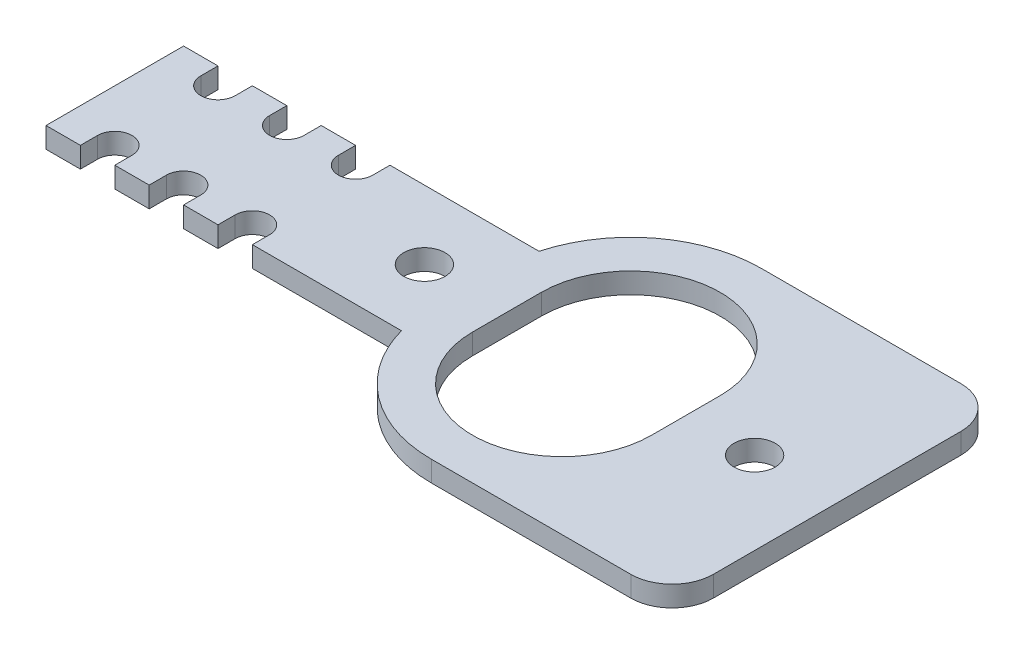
ISO-10303-21;
HEADER;
FILE_DESCRIPTION(('STEP AP214'),'2;1');
FILE_NAME('part.step','',(''),(''),'','','');
FILE_SCHEMA(('AUTOMOTIVE_DESIGN { 1 0 10303 214 1 1 1 1 }'));
ENDSEC;
DATA;
#1=APPLICATION_CONTEXT('core data for automotive mechanical design processes');
#2=APPLICATION_PROTOCOL_DEFINITION('international standard','automotive_design',2000,#1);
#3=PRODUCT_CONTEXT('',#1,'mechanical');
#4=PRODUCT('Part','Part','',(#3));
#5=PRODUCT_RELATED_PRODUCT_CATEGORY('part','',(#4));
#6=PRODUCT_DEFINITION_FORMATION('','',#4);
#7=PRODUCT_DEFINITION_CONTEXT('part definition',#1,'design');
#8=PRODUCT_DEFINITION('design','',#6,#7);
#9=PRODUCT_DEFINITION_SHAPE('','',#8);
#10=(LENGTH_UNIT() NAMED_UNIT(*) SI_UNIT(.MILLI.,.METRE.));
#11=(NAMED_UNIT(*) PLANE_ANGLE_UNIT() SI_UNIT($,.RADIAN.));
#12=(NAMED_UNIT(*) SI_UNIT($,.STERADIAN.) SOLID_ANGLE_UNIT());
#13=UNCERTAINTY_MEASURE_WITH_UNIT(LENGTH_MEASURE(1.E-05),#10,'distance_accuracy_value','');
#14=(GEOMETRIC_REPRESENTATION_CONTEXT(3) GLOBAL_UNCERTAINTY_ASSIGNED_CONTEXT((#13)) GLOBAL_UNIT_ASSIGNED_CONTEXT((#10,
#11,#12)) REPRESENTATION_CONTEXT('',''));
#15=CARTESIAN_POINT('',(0.,0.,0.));
#16=DIRECTION('',(0.,0.,1.));
#17=DIRECTION('',(1.,0.,0.));
#18=AXIS2_PLACEMENT_3D('',#15,#16,#17);
#19=CARTESIAN_POINT('',(7.5,3.,-31.5));
#20=DIRECTION('',(0.,1.,0.));
#21=DIRECTION('',(0.,0.,1.));
#22=AXIS2_PLACEMENT_3D('',#19,#20,#21);
#23=PLANE('',#22);
#24=CARTESIAN_POINT('',(45.,3.,-24.));
#25=DIRECTION('',(0.,1.,0.));
#26=DIRECTION('',(0.,0.,1.));
#27=AXIS2_PLACEMENT_3D('',#24,#25,#26);
#28=CIRCLE('',#27,3.);
#29=CARTESIAN_POINT('',(45.,3.,-21.));
#30=VERTEX_POINT('',#29);
#31=EDGE_CURVE('E305',#30,#30,#28,.T.);
#32=ORIENTED_EDGE('',*,*,#31,.F.);
#33=EDGE_LOOP('',(#32));
#34=FACE_BOUND('',#33,.T.);
#35=CARTESIAN_POINT('',(7.5,3.,-31.5));
#36=DIRECTION('',(0.,-1.,0.));
#37=DIRECTION('',(0.,0.,1.));
#38=AXIS2_PLACEMENT_3D('',#35,#36,#37);
#39=CIRCLE('',#38,2.5);
#40=CARTESIAN_POINT('',(10.,3.,-31.5));
#41=VERTEX_POINT('',#40);
#42=CARTESIAN_POINT('',(5.,3.,-31.5));
#43=VERTEX_POINT('',#42);
#44=EDGE_CURVE('E315',#41,#43,#39,.T.);
#45=ORIENTED_EDGE('',*,*,#44,.T.);
#46=DIRECTION('',(0.,0.,-1.));
#47=VECTOR('',#46,1.);
#48=CARTESIAN_POINT('',(5.,3.,-31.5));
#49=LINE('',#48,#47);
#50=CARTESIAN_POINT('',(5.,3.,-34.));
#51=VERTEX_POINT('',#50);
#52=EDGE_CURVE('E318',#43,#51,#49,.T.);
#53=ORIENTED_EDGE('',*,*,#52,.T.);
#54=DIRECTION('',(-1.,0.,0.));
#55=VECTOR('',#54,1.);
#56=CARTESIAN_POINT('',(0.,3.,-34.));
#57=LINE('',#56,#55);
#58=CARTESIAN_POINT('',(0.,3.,-34.));
#59=VERTEX_POINT('',#58);
#60=EDGE_CURVE('E321',#51,#59,#57,.T.);
#61=ORIENTED_EDGE('',*,*,#60,.T.);
#62=DIRECTION('',(0.,0.,1.));
#63=VECTOR('',#62,1.);
#64=CARTESIAN_POINT('',(0.,3.,-14.));
#65=LINE('',#64,#63);
#66=CARTESIAN_POINT('',(0.,3.,-14.));
#67=VERTEX_POINT('',#66);
#68=EDGE_CURVE('E323',#59,#67,#65,.T.);
#69=ORIENTED_EDGE('',*,*,#68,.T.);
#70=DIRECTION('',(1.,0.,0.));
#71=VECTOR('',#70,1.);
#72=CARTESIAN_POINT('',(0.,3.,-14.));
#73=LINE('',#72,#71);
#74=CARTESIAN_POINT('',(5.,3.,-14.));
#75=VERTEX_POINT('',#74);
#76=EDGE_CURVE('E325',#67,#75,#73,.T.);
#77=ORIENTED_EDGE('',*,*,#76,.T.);
#78=DIRECTION('',(0.,0.,-1.));
#79=VECTOR('',#78,1.);
#80=CARTESIAN_POINT('',(5.,3.,-16.5));
#81=LINE('',#80,#79);
#82=CARTESIAN_POINT('',(5.,3.,-16.5));
#83=VERTEX_POINT('',#82);
#84=EDGE_CURVE('E327',#75,#83,#81,.T.);
#85=ORIENTED_EDGE('',*,*,#84,.T.);
#86=CARTESIAN_POINT('',(7.5,3.,-16.5));
#87=DIRECTION('',(0.,-1.,0.));
#88=DIRECTION('',(0.,0.,1.));
#89=AXIS2_PLACEMENT_3D('',#86,#87,#88);
#90=CIRCLE('',#89,2.5);
#91=CARTESIAN_POINT('',(10.,3.,-16.5));
#92=VERTEX_POINT('',#91);
#93=EDGE_CURVE('E329',#83,#92,#90,.T.);
#94=ORIENTED_EDGE('',*,*,#93,.T.);
#95=DIRECTION('',(0.,0.,1.));
#96=VECTOR('',#95,1.);
#97=CARTESIAN_POINT('',(10.,3.,-16.5));
#98=LINE('',#97,#96);
#99=CARTESIAN_POINT('',(10.,3.,-14.));
#100=VERTEX_POINT('',#99);
#101=EDGE_CURVE('E331',#92,#100,#98,.T.);
#102=ORIENTED_EDGE('',*,*,#101,.T.);
#103=DIRECTION('',(1.,0.,0.));
#104=VECTOR('',#103,1.);
#105=CARTESIAN_POINT('',(10.,3.,-14.));
#106=LINE('',#105,#104);
#107=CARTESIAN_POINT('',(15.,3.,-14.));
#108=VERTEX_POINT('',#107);
#109=EDGE_CURVE('E333',#100,#108,#106,.T.);
#110=ORIENTED_EDGE('',*,*,#109,.T.);
#111=DIRECTION('',(0.,0.,-1.));
#112=VECTOR('',#111,1.);
#113=CARTESIAN_POINT('',(15.,3.,-16.5));
#114=LINE('',#113,#112);
#115=CARTESIAN_POINT('',(15.,3.,-16.5));
#116=VERTEX_POINT('',#115);
#117=EDGE_CURVE('E335',#108,#116,#114,.T.);
#118=ORIENTED_EDGE('',*,*,#117,.T.);
#119=CARTESIAN_POINT('',(17.5,3.,-16.5));
#120=DIRECTION('',(0.,-1.,0.));
#121=DIRECTION('',(0.,0.,1.));
#122=AXIS2_PLACEMENT_3D('',#119,#120,#121);
#123=CIRCLE('',#122,2.5);
#124=CARTESIAN_POINT('',(20.,3.,-16.5));
#125=VERTEX_POINT('',#124);
#126=EDGE_CURVE('E337',#116,#125,#123,.T.);
#127=ORIENTED_EDGE('',*,*,#126,.T.);
#128=DIRECTION('',(0.,0.,1.));
#129=VECTOR('',#128,1.);
#130=CARTESIAN_POINT('',(20.,3.,-16.5));
#131=LINE('',#130,#129);
#132=CARTESIAN_POINT('',(20.,3.,-14.));
#133=VERTEX_POINT('',#132);
#134=EDGE_CURVE('E339',#125,#133,#131,.T.);
#135=ORIENTED_EDGE('',*,*,#134,.T.);
#136=DIRECTION('',(1.,0.,0.));
#137=VECTOR('',#136,1.);
#138=CARTESIAN_POINT('',(20.,3.,-14.));
#139=LINE('',#138,#137);
#140=CARTESIAN_POINT('',(25.,3.,-14.));
#141=VERTEX_POINT('',#140);
#142=EDGE_CURVE('E341',#133,#141,#139,.T.);
#143=ORIENTED_EDGE('',*,*,#142,.T.);
#144=DIRECTION('',(0.,0.,-1.));
#145=VECTOR('',#144,1.);
#146=CARTESIAN_POINT('',(25.,3.,-16.5));
#147=LINE('',#146,#145);
#148=CARTESIAN_POINT('',(25.,3.,-16.5));
#149=VERTEX_POINT('',#148);
#150=EDGE_CURVE('E343',#141,#149,#147,.T.);
#151=ORIENTED_EDGE('',*,*,#150,.T.);
#152=CARTESIAN_POINT('',(27.5,3.,-16.5));
#153=DIRECTION('',(0.,-1.,0.));
#154=DIRECTION('',(0.,0.,1.));
#155=AXIS2_PLACEMENT_3D('',#152,#153,#154);
#156=CIRCLE('',#155,2.5);
#157=CARTESIAN_POINT('',(30.,3.,-16.5));
#158=VERTEX_POINT('',#157);
#159=EDGE_CURVE('E345',#149,#158,#156,.T.);
#160=ORIENTED_EDGE('',*,*,#159,.T.);
#161=DIRECTION('',(0.,0.,1.));
#162=VECTOR('',#161,1.);
#163=CARTESIAN_POINT('',(30.,3.,-16.5));
#164=LINE('',#163,#162);
#165=CARTESIAN_POINT('',(30.,3.,-14.));
#166=VERTEX_POINT('',#165);
#167=EDGE_CURVE('E347',#158,#166,#164,.T.);
#168=ORIENTED_EDGE('',*,*,#167,.T.);
#169=DIRECTION('',(1.,0.,0.));
#170=VECTOR('',#169,1.);
#171=CARTESIAN_POINT('',(30.,3.,-14.));
#172=LINE('',#171,#170);
#173=CARTESIAN_POINT('',(51.6696972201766,3.,-14.));
#174=VERTEX_POINT('',#173);
#175=EDGE_CURVE('E349',#166,#174,#172,.T.);
#176=ORIENTED_EDGE('',*,*,#175,.T.);
#177=CARTESIAN_POINT('',(70.,3.,-19.));
#178=DIRECTION('',(0.,1.,0.));
#179=DIRECTION('',(0.,0.,1.));
#180=AXIS2_PLACEMENT_3D('',#177,#178,#179);
#181=CIRCLE('',#180,19.);
#182=CARTESIAN_POINT('',(70.,3.,0.));
#183=VERTEX_POINT('',#182);
#184=EDGE_CURVE('E351',#174,#183,#181,.T.);
#185=ORIENTED_EDGE('',*,*,#184,.T.);
#186=DIRECTION('',(1.,0.,0.));
#187=VECTOR('',#186,1.);
#188=CARTESIAN_POINT('',(70.,3.,0.));
#189=LINE('',#188,#187);
#190=CARTESIAN_POINT('',(98.9999999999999,3.,0.));
#191=VERTEX_POINT('',#190);
#192=EDGE_CURVE('E353',#183,#191,#189,.T.);
#193=ORIENTED_EDGE('',*,*,#192,.T.);
#194=CARTESIAN_POINT('',(99.,3.,-6.));
#195=DIRECTION('',(0.,1.,0.));
#196=DIRECTION('',(0.,0.,1.));
#197=AXIS2_PLACEMENT_3D('',#194,#195,#196);
#198=CIRCLE('',#197,6.);
#199=CARTESIAN_POINT('',(105.,3.,-6.00000000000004));
#200=VERTEX_POINT('',#199);
#201=EDGE_CURVE('E355',#191,#200,#198,.T.);
#202=ORIENTED_EDGE('',*,*,#201,.T.);
#203=DIRECTION('',(0.,0.,-1.));
#204=VECTOR('',#203,1.);
#205=CARTESIAN_POINT('',(105.,3.,-6.00000000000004));
#206=LINE('',#205,#204);
#207=CARTESIAN_POINT('',(105.,3.,-42.));
#208=VERTEX_POINT('',#207);
#209=EDGE_CURVE('E357',#200,#208,#206,.T.);
#210=ORIENTED_EDGE('',*,*,#209,.T.);
#211=CARTESIAN_POINT('',(99.,3.,-42.));
#212=DIRECTION('',(0.,1.,0.));
#213=DIRECTION('',(0.,0.,1.));
#214=AXIS2_PLACEMENT_3D('',#211,#212,#213);
#215=CIRCLE('',#214,6.);
#216=CARTESIAN_POINT('',(98.9999999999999,3.,-48.));
#217=VERTEX_POINT('',#216);
#218=EDGE_CURVE('E359',#208,#217,#215,.T.);
#219=ORIENTED_EDGE('',*,*,#218,.T.);
#220=DIRECTION('',(-1.,0.,0.));
#221=VECTOR('',#220,1.);
#222=CARTESIAN_POINT('',(70.,3.,-48.));
#223=LINE('',#222,#221);
#224=CARTESIAN_POINT('',(70.,3.,-48.));
#225=VERTEX_POINT('',#224);
#226=EDGE_CURVE('E361',#217,#225,#223,.T.);
#227=ORIENTED_EDGE('',*,*,#226,.T.);
#228=CARTESIAN_POINT('',(70.,3.,-29.));
#229=DIRECTION('',(0.,1.,0.));
#230=DIRECTION('',(0.,0.,1.));
#231=AXIS2_PLACEMENT_3D('',#228,#229,#230);
#232=CIRCLE('',#231,19.);
#233=CARTESIAN_POINT('',(51.6696972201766,3.,-34.));
#234=VERTEX_POINT('',#233);
#235=EDGE_CURVE('E363',#225,#234,#232,.T.);
#236=ORIENTED_EDGE('',*,*,#235,.T.);
#237=DIRECTION('',(-1.,0.,0.));
#238=VECTOR('',#237,1.);
#239=CARTESIAN_POINT('',(30.,3.,-34.));
#240=LINE('',#239,#238);
#241=CARTESIAN_POINT('',(30.,3.,-34.));
#242=VERTEX_POINT('',#241);
#243=EDGE_CURVE('E365',#234,#242,#240,.T.);
#244=ORIENTED_EDGE('',*,*,#243,.T.);
#245=DIRECTION('',(0.,0.,1.));
#246=VECTOR('',#245,1.);
#247=CARTESIAN_POINT('',(30.,3.,-31.5));
#248=LINE('',#247,#246);
#249=CARTESIAN_POINT('',(30.,3.,-31.5));
#250=VERTEX_POINT('',#249);
#251=EDGE_CURVE('E367',#242,#250,#248,.T.);
#252=ORIENTED_EDGE('',*,*,#251,.T.);
#253=CARTESIAN_POINT('',(27.5,3.,-31.5));
#254=DIRECTION('',(0.,-1.,0.));
#255=DIRECTION('',(0.,0.,1.));
#256=AXIS2_PLACEMENT_3D('',#253,#254,#255);
#257=CIRCLE('',#256,2.5);
#258=CARTESIAN_POINT('',(25.,3.,-31.5));
#259=VERTEX_POINT('',#258);
#260=EDGE_CURVE('E369',#250,#259,#257,.T.);
#261=ORIENTED_EDGE('',*,*,#260,.T.);
#262=DIRECTION('',(0.,0.,-1.));
#263=VECTOR('',#262,1.);
#264=CARTESIAN_POINT('',(25.,3.,-31.5));
#265=LINE('',#264,#263);
#266=CARTESIAN_POINT('',(25.,3.,-34.));
#267=VERTEX_POINT('',#266);
#268=EDGE_CURVE('E371',#259,#267,#265,.T.);
#269=ORIENTED_EDGE('',*,*,#268,.T.);
#270=DIRECTION('',(-1.,0.,0.));
#271=VECTOR('',#270,1.);
#272=CARTESIAN_POINT('',(20.,3.,-34.));
#273=LINE('',#272,#271);
#274=CARTESIAN_POINT('',(20.,3.,-34.));
#275=VERTEX_POINT('',#274);
#276=EDGE_CURVE('E373',#267,#275,#273,.T.);
#277=ORIENTED_EDGE('',*,*,#276,.T.);
#278=DIRECTION('',(0.,0.,1.));
#279=VECTOR('',#278,1.);
#280=CARTESIAN_POINT('',(20.,3.,-31.5));
#281=LINE('',#280,#279);
#282=CARTESIAN_POINT('',(20.,3.,-31.5));
#283=VERTEX_POINT('',#282);
#284=EDGE_CURVE('E375',#275,#283,#281,.T.);
#285=ORIENTED_EDGE('',*,*,#284,.T.);
#286=CARTESIAN_POINT('',(17.5,3.,-31.5));
#287=DIRECTION('',(0.,-1.,0.));
#288=DIRECTION('',(0.,0.,1.));
#289=AXIS2_PLACEMENT_3D('',#286,#287,#288);
#290=CIRCLE('',#289,2.5);
#291=CARTESIAN_POINT('',(15.,3.,-31.5));
#292=VERTEX_POINT('',#291);
#293=EDGE_CURVE('E377',#283,#292,#290,.T.);
#294=ORIENTED_EDGE('',*,*,#293,.T.);
#295=DIRECTION('',(0.,0.,-1.));
#296=VECTOR('',#295,1.);
#297=CARTESIAN_POINT('',(15.,3.,-31.5));
#298=LINE('',#297,#296);
#299=CARTESIAN_POINT('',(15.,3.,-34.));
#300=VERTEX_POINT('',#299);
#301=EDGE_CURVE('E379',#292,#300,#298,.T.);
#302=ORIENTED_EDGE('',*,*,#301,.T.);
#303=DIRECTION('',(-1.,0.,0.));
#304=VECTOR('',#303,1.);
#305=CARTESIAN_POINT('',(10.,3.,-34.));
#306=LINE('',#305,#304);
#307=CARTESIAN_POINT('',(10.,3.,-34.));
#308=VERTEX_POINT('',#307);
#309=EDGE_CURVE('E381',#300,#308,#306,.T.);
#310=ORIENTED_EDGE('',*,*,#309,.T.);
#311=DIRECTION('',(0.,0.,1.));
#312=VECTOR('',#311,1.);
#313=CARTESIAN_POINT('',(10.,3.,-31.5));
#314=LINE('',#313,#312);
#315=EDGE_CURVE('E383',#308,#41,#314,.T.);
#316=ORIENTED_EDGE('',*,*,#315,.T.);
#317=EDGE_LOOP('',(#45,#53,#61,#69,#77,#85,#94,#102,#110,#118,#127,#135,#143,#151,#160,#168,
#176,#185,#193,#202,#210,#219,#227,#236,#244,#252,#261,#269,#277,#285,#294,#302,#310,#316));
#318=FACE_BOUND('',#317,.T.);
#319=DIRECTION('',(0.,0.,1.));
#320=VECTOR('',#319,1.);
#321=CARTESIAN_POINT('',(57.,3.,-29.));
#322=LINE('',#321,#320);
#323=CARTESIAN_POINT('',(57.,3.,-29.));
#324=VERTEX_POINT('',#323);
#325=CARTESIAN_POINT('',(57.,3.,-19.));
#326=VERTEX_POINT('',#325);
#327=EDGE_CURVE('E284',#324,#326,#322,.T.);
#328=ORIENTED_EDGE('',*,*,#327,.F.);
#329=CARTESIAN_POINT('',(70.,3.,-29.));
#330=DIRECTION('',(0.,1.,0.));
#331=DIRECTION('',(0.,0.,1.));
#332=AXIS2_PLACEMENT_3D('',#329,#330,#331);
#333=CIRCLE('',#332,13.);
#334=CARTESIAN_POINT('',(83.,3.,-29.));
#335=VERTEX_POINT('',#334);
#336=EDGE_CURVE('E276',#335,#324,#333,.T.);
#337=ORIENTED_EDGE('',*,*,#336,.F.);
#338=DIRECTION('',(0.,0.,-1.));
#339=VECTOR('',#338,1.);
#340=CARTESIAN_POINT('',(83.,3.,-29.));
#341=LINE('',#340,#339);
#342=CARTESIAN_POINT('',(83.,3.,-19.));
#343=VERTEX_POINT('',#342);
#344=EDGE_CURVE('E299',#343,#335,#341,.T.);
#345=ORIENTED_EDGE('',*,*,#344,.F.);
#346=CARTESIAN_POINT('',(70.,3.,-19.));
#347=DIRECTION('',(0.,1.,0.));
#348=DIRECTION('',(0.,0.,1.));
#349=AXIS2_PLACEMENT_3D('',#346,#347,#348);
#350=CIRCLE('',#349,13.);
#351=EDGE_CURVE('E297',#326,#343,#350,.T.);
#352=ORIENTED_EDGE('',*,*,#351,.F.);
#353=EDGE_LOOP('',(#328,#337,#345,#352));
#354=FACE_BOUND('',#353,.T.);
#355=CARTESIAN_POINT('',(93.,3.,-24.));
#356=DIRECTION('',(0.,1.,0.));
#357=DIRECTION('',(0.,0.,1.));
#358=AXIS2_PLACEMENT_3D('',#355,#356,#357);
#359=CIRCLE('',#358,3.00000000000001);
#360=CARTESIAN_POINT('',(93.,3.,-21.));
#361=VERTEX_POINT('',#360);
#362=EDGE_CURVE('E1066',#361,#361,#359,.T.);
#363=ORIENTED_EDGE('',*,*,#362,.F.);
#364=EDGE_LOOP('',(#363));
#365=FACE_BOUND('',#364,.T.);
#366=ADVANCED_FACE('F31',(#34,#318,#354,#365),#23,.T.);
#367=CARTESIAN_POINT('',(7.5,0.,-31.5));
#368=DIRECTION('',(0.,1.,0.));
#369=DIRECTION('',(0.,0.,1.));
#370=AXIS2_PLACEMENT_3D('',#367,#368,#369);
#371=PLANE('',#370);
#372=CARTESIAN_POINT('',(45.,0.,-24.));
#373=DIRECTION('',(0.,1.,0.));
#374=DIRECTION('',(0.,0.,1.));
#375=AXIS2_PLACEMENT_3D('',#372,#373,#374);
#376=CIRCLE('',#375,3.);
#377=CARTESIAN_POINT('',(45.,0.,-21.));
#378=VERTEX_POINT('',#377);
#379=EDGE_CURVE('E1072',#378,#378,#376,.T.);
#380=ORIENTED_EDGE('',*,*,#379,.T.);
#381=EDGE_LOOP('',(#380));
#382=FACE_BOUND('',#381,.T.);
#383=CARTESIAN_POINT('',(7.5,0.,-31.5));
#384=DIRECTION('',(0.,-1.,0.));
#385=DIRECTION('',(0.,0.,1.));
#386=AXIS2_PLACEMENT_3D('',#383,#384,#385);
#387=CIRCLE('',#386,2.5);
#388=CARTESIAN_POINT('',(10.,0.,-31.5));
#389=VERTEX_POINT('',#388);
#390=CARTESIAN_POINT('',(5.,0.,-31.5));
#391=VERTEX_POINT('',#390);
#392=EDGE_CURVE('E292',#389,#391,#387,.T.);
#393=ORIENTED_EDGE('',*,*,#392,.F.);
#394=DIRECTION('',(0.,0.,1.));
#395=VECTOR('',#394,1.);
#396=CARTESIAN_POINT('',(10.,0.,-31.5));
#397=LINE('',#396,#395);
#398=CARTESIAN_POINT('',(10.,0.,-34.));
#399=VERTEX_POINT('',#398);
#400=EDGE_CURVE('E319',#399,#389,#397,.T.);
#401=ORIENTED_EDGE('',*,*,#400,.F.);
#402=DIRECTION('',(-1.,0.,0.));
#403=VECTOR('',#402,1.);
#404=CARTESIAN_POINT('',(10.,0.,-34.));
#405=LINE('',#404,#403);
#406=CARTESIAN_POINT('',(15.,0.,-34.));
#407=VERTEX_POINT('',#406);
#408=EDGE_CURVE('E450',#407,#399,#405,.T.);
#409=ORIENTED_EDGE('',*,*,#408,.F.);
#410=DIRECTION('',(0.,0.,-1.));
#411=VECTOR('',#410,1.);
#412=CARTESIAN_POINT('',(15.,0.,-31.5));
#413=LINE('',#412,#411);
#414=CARTESIAN_POINT('',(15.,0.,-31.5));
#415=VERTEX_POINT('',#414);
#416=EDGE_CURVE('E448',#415,#407,#413,.T.);
#417=ORIENTED_EDGE('',*,*,#416,.F.);
#418=CARTESIAN_POINT('',(17.5,0.,-31.5));
#419=DIRECTION('',(0.,-1.,0.));
#420=DIRECTION('',(0.,0.,1.));
#421=AXIS2_PLACEMENT_3D('',#418,#419,#420);
#422=CIRCLE('',#421,2.5);
#423=CARTESIAN_POINT('',(20.,0.,-31.5));
#424=VERTEX_POINT('',#423);
#425=EDGE_CURVE('E446',#424,#415,#422,.T.);
#426=ORIENTED_EDGE('',*,*,#425,.F.);
#427=DIRECTION('',(0.,0.,1.));
#428=VECTOR('',#427,1.);
#429=CARTESIAN_POINT('',(20.,0.,-31.5));
#430=LINE('',#429,#428);
#431=CARTESIAN_POINT('',(20.,0.,-34.));
#432=VERTEX_POINT('',#431);
#433=EDGE_CURVE('E444',#432,#424,#430,.T.);
#434=ORIENTED_EDGE('',*,*,#433,.F.);
#435=DIRECTION('',(-1.,0.,0.));
#436=VECTOR('',#435,1.);
#437=CARTESIAN_POINT('',(20.,0.,-34.));
#438=LINE('',#437,#436);
#439=CARTESIAN_POINT('',(25.,0.,-34.));
#440=VERTEX_POINT('',#439);
#441=EDGE_CURVE('E442',#440,#432,#438,.T.);
#442=ORIENTED_EDGE('',*,*,#441,.F.);
#443=DIRECTION('',(0.,0.,-1.));
#444=VECTOR('',#443,1.);
#445=CARTESIAN_POINT('',(25.,0.,-31.5));
#446=LINE('',#445,#444);
#447=CARTESIAN_POINT('',(25.,0.,-31.5));
#448=VERTEX_POINT('',#447);
#449=EDGE_CURVE('E440',#448,#440,#446,.T.);
#450=ORIENTED_EDGE('',*,*,#449,.F.);
#451=CARTESIAN_POINT('',(27.5,0.,-31.5));
#452=DIRECTION('',(0.,-1.,0.));
#453=DIRECTION('',(0.,0.,1.));
#454=AXIS2_PLACEMENT_3D('',#451,#452,#453);
#455=CIRCLE('',#454,2.5);
#456=CARTESIAN_POINT('',(30.,0.,-31.5));
#457=VERTEX_POINT('',#456);
#458=EDGE_CURVE('E438',#457,#448,#455,.T.);
#459=ORIENTED_EDGE('',*,*,#458,.F.);
#460=DIRECTION('',(0.,0.,1.));
#461=VECTOR('',#460,1.);
#462=CARTESIAN_POINT('',(30.,0.,-31.5));
#463=LINE('',#462,#461);
#464=CARTESIAN_POINT('',(30.,0.,-34.));
#465=VERTEX_POINT('',#464);
#466=EDGE_CURVE('E436',#465,#457,#463,.T.);
#467=ORIENTED_EDGE('',*,*,#466,.F.);
#468=DIRECTION('',(-1.,0.,0.));
#469=VECTOR('',#468,1.);
#470=CARTESIAN_POINT('',(30.,0.,-34.));
#471=LINE('',#470,#469);
#472=CARTESIAN_POINT('',(51.6696972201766,0.,-34.));
#473=VERTEX_POINT('',#472);
#474=EDGE_CURVE('E434',#473,#465,#471,.T.);
#475=ORIENTED_EDGE('',*,*,#474,.F.);
#476=CARTESIAN_POINT('',(70.,0.,-29.));
#477=DIRECTION('',(0.,1.,0.));
#478=DIRECTION('',(0.,0.,1.));
#479=AXIS2_PLACEMENT_3D('',#476,#477,#478);
#480=CIRCLE('',#479,19.);
#481=CARTESIAN_POINT('',(70.,0.,-48.));
#482=VERTEX_POINT('',#481);
#483=EDGE_CURVE('E432',#482,#473,#480,.T.);
#484=ORIENTED_EDGE('',*,*,#483,.F.);
#485=DIRECTION('',(-1.,0.,0.));
#486=VECTOR('',#485,1.);
#487=CARTESIAN_POINT('',(70.,0.,-48.));
#488=LINE('',#487,#486);
#489=CARTESIAN_POINT('',(98.9999999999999,0.,-48.));
#490=VERTEX_POINT('',#489);
#491=EDGE_CURVE('E430',#490,#482,#488,.T.);
#492=ORIENTED_EDGE('',*,*,#491,.F.);
#493=CARTESIAN_POINT('',(99.,0.,-42.));
#494=DIRECTION('',(0.,1.,0.));
#495=DIRECTION('',(0.,0.,1.));
#496=AXIS2_PLACEMENT_3D('',#493,#494,#495);
#497=CIRCLE('',#496,6.);
#498=CARTESIAN_POINT('',(105.,0.,-42.));
#499=VERTEX_POINT('',#498);
#500=EDGE_CURVE('E428',#499,#490,#497,.T.);
#501=ORIENTED_EDGE('',*,*,#500,.F.);
#502=DIRECTION('',(0.,0.,-1.));
#503=VECTOR('',#502,1.);
#504=CARTESIAN_POINT('',(105.,0.,-6.00000000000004));
#505=LINE('',#504,#503);
#506=CARTESIAN_POINT('',(105.,0.,-6.00000000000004));
#507=VERTEX_POINT('',#506);
#508=EDGE_CURVE('E426',#507,#499,#505,.T.);
#509=ORIENTED_EDGE('',*,*,#508,.F.);
#510=CARTESIAN_POINT('',(99.,0.,-6.));
#511=DIRECTION('',(0.,1.,0.));
#512=DIRECTION('',(0.,0.,1.));
#513=AXIS2_PLACEMENT_3D('',#510,#511,#512);
#514=CIRCLE('',#513,6.);
#515=CARTESIAN_POINT('',(98.9999999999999,0.,0.));
#516=VERTEX_POINT('',#515);
#517=EDGE_CURVE('E424',#516,#507,#514,.T.);
#518=ORIENTED_EDGE('',*,*,#517,.F.);
#519=DIRECTION('',(1.,0.,0.));
#520=VECTOR('',#519,1.);
#521=CARTESIAN_POINT('',(70.,0.,0.));
#522=LINE('',#521,#520);
#523=CARTESIAN_POINT('',(70.,0.,0.));
#524=VERTEX_POINT('',#523);
#525=EDGE_CURVE('E422',#524,#516,#522,.T.);
#526=ORIENTED_EDGE('',*,*,#525,.F.);
#527=CARTESIAN_POINT('',(70.,0.,-19.));
#528=DIRECTION('',(0.,1.,0.));
#529=DIRECTION('',(0.,0.,1.));
#530=AXIS2_PLACEMENT_3D('',#527,#528,#529);
#531=CIRCLE('',#530,19.);
#532=CARTESIAN_POINT('',(51.6696972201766,0.,-14.));
#533=VERTEX_POINT('',#532);
#534=EDGE_CURVE('E420',#533,#524,#531,.T.);
#535=ORIENTED_EDGE('',*,*,#534,.F.);
#536=DIRECTION('',(1.,0.,0.));
#537=VECTOR('',#536,1.);
#538=CARTESIAN_POINT('',(30.,0.,-14.));
#539=LINE('',#538,#537);
#540=CARTESIAN_POINT('',(30.,0.,-14.));
#541=VERTEX_POINT('',#540);
#542=EDGE_CURVE('E418',#541,#533,#539,.T.);
#543=ORIENTED_EDGE('',*,*,#542,.F.);
#544=DIRECTION('',(0.,0.,1.));
#545=VECTOR('',#544,1.);
#546=CARTESIAN_POINT('',(30.,0.,-16.5));
#547=LINE('',#546,#545);
#548=CARTESIAN_POINT('',(30.,0.,-16.5));
#549=VERTEX_POINT('',#548);
#550=EDGE_CURVE('E416',#549,#541,#547,.T.);
#551=ORIENTED_EDGE('',*,*,#550,.F.);
#552=CARTESIAN_POINT('',(27.5,0.,-16.5));
#553=DIRECTION('',(0.,-1.,0.));
#554=DIRECTION('',(0.,0.,1.));
#555=AXIS2_PLACEMENT_3D('',#552,#553,#554);
#556=CIRCLE('',#555,2.5);
#557=CARTESIAN_POINT('',(25.,0.,-16.5));
#558=VERTEX_POINT('',#557);
#559=EDGE_CURVE('E414',#558,#549,#556,.T.);
#560=ORIENTED_EDGE('',*,*,#559,.F.);
#561=DIRECTION('',(0.,0.,-1.));
#562=VECTOR('',#561,1.);
#563=CARTESIAN_POINT('',(25.,0.,-16.5));
#564=LINE('',#563,#562);
#565=CARTESIAN_POINT('',(25.,0.,-14.));
#566=VERTEX_POINT('',#565);
#567=EDGE_CURVE('E412',#566,#558,#564,.T.);
#568=ORIENTED_EDGE('',*,*,#567,.F.);
#569=DIRECTION('',(1.,0.,0.));
#570=VECTOR('',#569,1.);
#571=CARTESIAN_POINT('',(20.,0.,-14.));
#572=LINE('',#571,#570);
#573=CARTESIAN_POINT('',(20.,0.,-14.));
#574=VERTEX_POINT('',#573);
#575=EDGE_CURVE('E410',#574,#566,#572,.T.);
#576=ORIENTED_EDGE('',*,*,#575,.F.);
#577=DIRECTION('',(0.,0.,1.));
#578=VECTOR('',#577,1.);
#579=CARTESIAN_POINT('',(20.,0.,-16.5));
#580=LINE('',#579,#578);
#581=CARTESIAN_POINT('',(20.,0.,-16.5));
#582=VERTEX_POINT('',#581);
#583=EDGE_CURVE('E408',#582,#574,#580,.T.);
#584=ORIENTED_EDGE('',*,*,#583,.F.);
#585=CARTESIAN_POINT('',(17.5,0.,-16.5));
#586=DIRECTION('',(0.,-1.,0.));
#587=DIRECTION('',(0.,0.,1.));
#588=AXIS2_PLACEMENT_3D('',#585,#586,#587);
#589=CIRCLE('',#588,2.5);
#590=CARTESIAN_POINT('',(15.,0.,-16.5));
#591=VERTEX_POINT('',#590);
#592=EDGE_CURVE('E406',#591,#582,#589,.T.);
#593=ORIENTED_EDGE('',*,*,#592,.F.);
#594=DIRECTION('',(0.,0.,-1.));
#595=VECTOR('',#594,1.);
#596=CARTESIAN_POINT('',(15.,0.,-16.5));
#597=LINE('',#596,#595);
#598=CARTESIAN_POINT('',(15.,0.,-14.));
#599=VERTEX_POINT('',#598);
#600=EDGE_CURVE('E404',#599,#591,#597,.T.);
#601=ORIENTED_EDGE('',*,*,#600,.F.);
#602=DIRECTION('',(1.,0.,0.));
#603=VECTOR('',#602,1.);
#604=CARTESIAN_POINT('',(10.,0.,-14.));
#605=LINE('',#604,#603);
#606=CARTESIAN_POINT('',(10.,0.,-14.));
#607=VERTEX_POINT('',#606);
#608=EDGE_CURVE('E402',#607,#599,#605,.T.);
#609=ORIENTED_EDGE('',*,*,#608,.F.);
#610=DIRECTION('',(0.,0.,1.));
#611=VECTOR('',#610,1.);
#612=CARTESIAN_POINT('',(10.,0.,-16.5));
#613=LINE('',#612,#611);
#614=CARTESIAN_POINT('',(10.,0.,-16.5));
#615=VERTEX_POINT('',#614);
#616=EDGE_CURVE('E400',#615,#607,#613,.T.);
#617=ORIENTED_EDGE('',*,*,#616,.F.);
#618=CARTESIAN_POINT('',(7.5,0.,-16.5));
#619=DIRECTION('',(0.,-1.,0.));
#620=DIRECTION('',(0.,0.,1.));
#621=AXIS2_PLACEMENT_3D('',#618,#619,#620);
#622=CIRCLE('',#621,2.5);
#623=CARTESIAN_POINT('',(5.,0.,-16.5));
#624=VERTEX_POINT('',#623);
#625=EDGE_CURVE('E398',#624,#615,#622,.T.);
#626=ORIENTED_EDGE('',*,*,#625,.F.);
#627=DIRECTION('',(0.,0.,-1.));
#628=VECTOR('',#627,1.);
#629=CARTESIAN_POINT('',(5.,0.,-16.5));
#630=LINE('',#629,#628);
#631=CARTESIAN_POINT('',(5.,0.,-14.));
#632=VERTEX_POINT('',#631);
#633=EDGE_CURVE('E396',#632,#624,#630,.T.);
#634=ORIENTED_EDGE('',*,*,#633,.F.);
#635=DIRECTION('',(1.,0.,0.));
#636=VECTOR('',#635,1.);
#637=CARTESIAN_POINT('',(0.,0.,-14.));
#638=LINE('',#637,#636);
#639=CARTESIAN_POINT('',(0.,0.,-14.));
#640=VERTEX_POINT('',#639);
#641=EDGE_CURVE('E394',#640,#632,#638,.T.);
#642=ORIENTED_EDGE('',*,*,#641,.F.);
#643=DIRECTION('',(0.,0.,1.));
#644=VECTOR('',#643,1.);
#645=CARTESIAN_POINT('',(0.,0.,-14.));
#646=LINE('',#645,#644);
#647=CARTESIAN_POINT('',(0.,0.,-34.));
#648=VERTEX_POINT('',#647);
#649=EDGE_CURVE('E392',#648,#640,#646,.T.);
#650=ORIENTED_EDGE('',*,*,#649,.F.);
#651=DIRECTION('',(-1.,0.,0.));
#652=VECTOR('',#651,1.);
#653=CARTESIAN_POINT('',(0.,0.,-34.));
#654=LINE('',#653,#652);
#655=CARTESIAN_POINT('',(5.,0.,-34.));
#656=VERTEX_POINT('',#655);
#657=EDGE_CURVE('E390',#656,#648,#654,.T.);
#658=ORIENTED_EDGE('',*,*,#657,.F.);
#659=DIRECTION('',(0.,0.,-1.));
#660=VECTOR('',#659,1.);
#661=CARTESIAN_POINT('',(5.,0.,-31.5));
#662=LINE('',#661,#660);
#663=EDGE_CURVE('E388',#391,#656,#662,.T.);
#664=ORIENTED_EDGE('',*,*,#663,.F.);
#665=EDGE_LOOP('',(#393,#401,#409,#417,#426,#434,#442,#450,#459,#467,#475,#484,#492,#501,#509,
#518,#526,#535,#543,#551,#560,#568,#576,#584,#593,#601,#609,#617,#626,#634,#642,#650,#658,#664));
#666=FACE_BOUND('',#665,.T.);
#667=CARTESIAN_POINT('',(70.,0.,-29.));
#668=DIRECTION('',(0.,1.,0.));
#669=DIRECTION('',(0.,0.,1.));
#670=AXIS2_PLACEMENT_3D('',#667,#668,#669);
#671=CIRCLE('',#670,13.);
#672=CARTESIAN_POINT('',(83.,0.,-29.));
#673=VERTEX_POINT('',#672);
#674=CARTESIAN_POINT('',(57.,0.,-29.));
#675=VERTEX_POINT('',#674);
#676=EDGE_CURVE('E54',#673,#675,#671,.T.);
#677=ORIENTED_EDGE('',*,*,#676,.T.);
#678=DIRECTION('',(0.,0.,1.));
#679=VECTOR('',#678,1.);
#680=CARTESIAN_POINT('',(57.,0.,-29.));
#681=LINE('',#680,#679);
#682=CARTESIAN_POINT('',(57.,0.,-19.));
#683=VERTEX_POINT('',#682);
#684=EDGE_CURVE('E291',#675,#683,#681,.T.);
#685=ORIENTED_EDGE('',*,*,#684,.T.);
#686=CARTESIAN_POINT('',(70.,0.,-19.));
#687=DIRECTION('',(0.,1.,0.));
#688=DIRECTION('',(0.,0.,1.));
#689=AXIS2_PLACEMENT_3D('',#686,#687,#688);
#690=CIRCLE('',#689,13.);
#691=CARTESIAN_POINT('',(83.,0.,-19.));
#692=VERTEX_POINT('',#691);
#693=EDGE_CURVE('E307',#683,#692,#690,.T.);
#694=ORIENTED_EDGE('',*,*,#693,.T.);
#695=DIRECTION('',(0.,0.,-1.));
#696=VECTOR('',#695,1.);
#697=CARTESIAN_POINT('',(83.,0.,-29.));
#698=LINE('',#697,#696);
#699=EDGE_CURVE('E285',#692,#673,#698,.T.);
#700=ORIENTED_EDGE('',*,*,#699,.T.);
#701=EDGE_LOOP('',(#677,#685,#694,#700));
#702=FACE_BOUND('',#701,.T.);
#703=CARTESIAN_POINT('',(93.,0.,-24.));
#704=DIRECTION('',(0.,1.,0.));
#705=DIRECTION('',(0.,0.,1.));
#706=AXIS2_PLACEMENT_3D('',#703,#704,#705);
#707=CIRCLE('',#706,3.00000000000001);
#708=CARTESIAN_POINT('',(93.,0.,-21.));
#709=VERTEX_POINT('',#708);
#710=EDGE_CURVE('E1069',#709,#709,#707,.T.);
#711=ORIENTED_EDGE('',*,*,#710,.T.);
#712=EDGE_LOOP('',(#711));
#713=FACE_BOUND('',#712,.T.);
#714=ADVANCED_FACE('F558',(#382,#666,#702,#713),#371,.F.);
#715=CARTESIAN_POINT('',(7.5,3.,-31.5));
#716=DIRECTION('',(0.,-1.,0.));
#717=DIRECTION('',(0.,0.,-1.));
#718=AXIS2_PLACEMENT_3D('',#715,#716,#717);
#719=CYLINDRICAL_SURFACE('',#718,2.5);
#720=ORIENTED_EDGE('',*,*,#392,.T.);
#721=DIRECTION('',(0.,-1.,0.));
#722=VECTOR('',#721,1.);
#723=CARTESIAN_POINT('',(5.,3.,-31.5));
#724=LINE('',#723,#722);
#725=EDGE_CURVE('E11',#43,#391,#724,.T.);
#726=ORIENTED_EDGE('',*,*,#725,.F.);
#727=ORIENTED_EDGE('',*,*,#44,.F.);
#728=DIRECTION('',(0.,-1.,0.));
#729=VECTOR('',#728,1.);
#730=CARTESIAN_POINT('',(10.,3.,-31.5));
#731=LINE('',#730,#729);
#732=EDGE_CURVE('E385',#41,#389,#731,.T.);
#733=ORIENTED_EDGE('',*,*,#732,.T.);
#734=EDGE_LOOP('',(#720,#726,#727,#733));
#735=FACE_BOUND('',#734,.T.);
#736=ADVANCED_FACE('F33',(#735),#719,.F.);
#737=CARTESIAN_POINT('',(5.,3.,-31.5));
#738=DIRECTION('',(-1.,0.,0.));
#739=DIRECTION('',(0.,0.,1.));
#740=AXIS2_PLACEMENT_3D('',#737,#738,#739);
#741=PLANE('',#740);
#742=ORIENTED_EDGE('',*,*,#663,.T.);
#743=DIRECTION('',(0.,-1.,0.));
#744=VECTOR('',#743,1.);
#745=CARTESIAN_POINT('',(5.,3.,-34.));
#746=LINE('',#745,#744);
#747=EDGE_CURVE('E39',#51,#656,#746,.T.);
#748=ORIENTED_EDGE('',*,*,#747,.F.);
#749=ORIENTED_EDGE('',*,*,#52,.F.);
#750=ORIENTED_EDGE('',*,*,#725,.T.);
#751=EDGE_LOOP('',(#742,#748,#749,#750));
#752=FACE_BOUND('',#751,.T.);
#753=ADVANCED_FACE('F575',(#752),#741,.F.);
#754=CARTESIAN_POINT('',(0.,3.,-34.));
#755=DIRECTION('',(0.,0.,1.));
#756=DIRECTION('',(1.,0.,0.));
#757=AXIS2_PLACEMENT_3D('',#754,#755,#756);
#758=PLANE('',#757);
#759=ORIENTED_EDGE('',*,*,#657,.T.);
#760=DIRECTION('',(0.,-1.,0.));
#761=VECTOR('',#760,1.);
#762=CARTESIAN_POINT('',(0.,3.,-34.));
#763=LINE('',#762,#761);
#764=EDGE_CURVE('E545',#59,#648,#763,.T.);
#765=ORIENTED_EDGE('',*,*,#764,.F.);
#766=ORIENTED_EDGE('',*,*,#60,.F.);
#767=ORIENTED_EDGE('',*,*,#747,.T.);
#768=EDGE_LOOP('',(#759,#765,#766,#767));
#769=FACE_BOUND('',#768,.T.);
#770=ADVANCED_FACE('F552',(#769),#758,.F.);
#771=CARTESIAN_POINT('',(0.,3.,-14.));
#772=DIRECTION('',(1.,0.,0.));
#773=DIRECTION('',(0.,0.,-1.));
#774=AXIS2_PLACEMENT_3D('',#771,#772,#773);
#775=PLANE('',#774);
#776=ORIENTED_EDGE('',*,*,#649,.T.);
#777=DIRECTION('',(0.,-1.,0.));
#778=VECTOR('',#777,1.);
#779=CARTESIAN_POINT('',(0.,3.,-14.));
#780=LINE('',#779,#778);
#781=EDGE_CURVE('E542',#67,#640,#780,.T.);
#782=ORIENTED_EDGE('',*,*,#781,.F.);
#783=ORIENTED_EDGE('',*,*,#68,.F.);
#784=ORIENTED_EDGE('',*,*,#764,.T.);
#785=EDGE_LOOP('',(#776,#782,#783,#784));
#786=FACE_BOUND('',#785,.T.);
#787=ADVANCED_FACE('F564',(#786),#775,.F.);
#788=CARTESIAN_POINT('',(0.,3.,-14.));
#789=DIRECTION('',(0.,0.,-1.));
#790=DIRECTION('',(-1.,0.,0.));
#791=AXIS2_PLACEMENT_3D('',#788,#789,#790);
#792=PLANE('',#791);
#793=ORIENTED_EDGE('',*,*,#641,.T.);
#794=DIRECTION('',(0.,-1.,0.));
#795=VECTOR('',#794,1.);
#796=CARTESIAN_POINT('',(5.,3.,-14.));
#797=LINE('',#796,#795);
#798=EDGE_CURVE('E539',#75,#632,#797,.T.);
#799=ORIENTED_EDGE('',*,*,#798,.F.);
#800=ORIENTED_EDGE('',*,*,#76,.F.);
#801=ORIENTED_EDGE('',*,*,#781,.T.);
#802=EDGE_LOOP('',(#793,#799,#800,#801));
#803=FACE_BOUND('',#802,.T.);
#804=ADVANCED_FACE('F568',(#803),#792,.F.);
#805=CARTESIAN_POINT('',(5.,3.,-16.5));
#806=DIRECTION('',(-1.,0.,0.));
#807=DIRECTION('',(0.,0.,1.));
#808=AXIS2_PLACEMENT_3D('',#805,#806,#807);
#809=PLANE('',#808);
#810=ORIENTED_EDGE('',*,*,#633,.T.);
#811=DIRECTION('',(0.,-1.,0.));
#812=VECTOR('',#811,1.);
#813=CARTESIAN_POINT('',(5.,3.,-16.5));
#814=LINE('',#813,#812);
#815=EDGE_CURVE('E536',#83,#624,#814,.T.);
#816=ORIENTED_EDGE('',*,*,#815,.F.);
#817=ORIENTED_EDGE('',*,*,#84,.F.);
#818=ORIENTED_EDGE('',*,*,#798,.T.);
#819=EDGE_LOOP('',(#810,#816,#817,#818));
#820=FACE_BOUND('',#819,.T.);
#821=ADVANCED_FACE('F718',(#820),#809,.F.);
#822=CARTESIAN_POINT('',(7.5,3.,-16.5));
#823=DIRECTION('',(0.,-1.,0.));
#824=DIRECTION('',(0.,0.,-1.));
#825=AXIS2_PLACEMENT_3D('',#822,#823,#824);
#826=CYLINDRICAL_SURFACE('',#825,2.5);
#827=ORIENTED_EDGE('',*,*,#625,.T.);
#828=DIRECTION('',(0.,-1.,0.));
#829=VECTOR('',#828,1.);
#830=CARTESIAN_POINT('',(10.,3.,-16.5));
#831=LINE('',#830,#829);
#832=EDGE_CURVE('E533',#92,#615,#831,.T.);
#833=ORIENTED_EDGE('',*,*,#832,.F.);
#834=ORIENTED_EDGE('',*,*,#93,.F.);
#835=ORIENTED_EDGE('',*,*,#815,.T.);
#836=EDGE_LOOP('',(#827,#833,#834,#835));
#837=FACE_BOUND('',#836,.T.);
#838=ADVANCED_FACE('F715',(#837),#826,.F.);
#839=CARTESIAN_POINT('',(10.,3.,-16.5));
#840=DIRECTION('',(1.,0.,0.));
#841=DIRECTION('',(0.,0.,-1.));
#842=AXIS2_PLACEMENT_3D('',#839,#840,#841);
#843=PLANE('',#842);
#844=ORIENTED_EDGE('',*,*,#616,.T.);
#845=DIRECTION('',(0.,-1.,0.));
#846=VECTOR('',#845,1.);
#847=CARTESIAN_POINT('',(10.,3.,-14.));
#848=LINE('',#847,#846);
#849=EDGE_CURVE('E530',#100,#607,#848,.T.);
#850=ORIENTED_EDGE('',*,*,#849,.F.);
#851=ORIENTED_EDGE('',*,*,#101,.F.);
#852=ORIENTED_EDGE('',*,*,#832,.T.);
#853=EDGE_LOOP('',(#844,#850,#851,#852));
#854=FACE_BOUND('',#853,.T.);
#855=ADVANCED_FACE('F711',(#854),#843,.F.);
#856=CARTESIAN_POINT('',(10.,3.,-14.));
#857=DIRECTION('',(0.,0.,-1.));
#858=DIRECTION('',(-1.,0.,0.));
#859=AXIS2_PLACEMENT_3D('',#856,#857,#858);
#860=PLANE('',#859);
#861=ORIENTED_EDGE('',*,*,#608,.T.);
#862=DIRECTION('',(0.,-1.,0.));
#863=VECTOR('',#862,1.);
#864=CARTESIAN_POINT('',(15.,3.,-14.));
#865=LINE('',#864,#863);
#866=EDGE_CURVE('E527',#108,#599,#865,.T.);
#867=ORIENTED_EDGE('',*,*,#866,.F.);
#868=ORIENTED_EDGE('',*,*,#109,.F.);
#869=ORIENTED_EDGE('',*,*,#849,.T.);
#870=EDGE_LOOP('',(#861,#867,#868,#869));
#871=FACE_BOUND('',#870,.T.);
#872=ADVANCED_FACE('F707',(#871),#860,.F.);
#873=CARTESIAN_POINT('',(15.,3.,-16.5));
#874=DIRECTION('',(-1.,0.,0.));
#875=DIRECTION('',(0.,0.,1.));
#876=AXIS2_PLACEMENT_3D('',#873,#874,#875);
#877=PLANE('',#876);
#878=ORIENTED_EDGE('',*,*,#600,.T.);
#879=DIRECTION('',(0.,-1.,0.));
#880=VECTOR('',#879,1.);
#881=CARTESIAN_POINT('',(15.,3.,-16.5));
#882=LINE('',#881,#880);
#883=EDGE_CURVE('E524',#116,#591,#882,.T.);
#884=ORIENTED_EDGE('',*,*,#883,.F.);
#885=ORIENTED_EDGE('',*,*,#117,.F.);
#886=ORIENTED_EDGE('',*,*,#866,.T.);
#887=EDGE_LOOP('',(#878,#884,#885,#886));
#888=FACE_BOUND('',#887,.T.);
#889=ADVANCED_FACE('F702',(#888),#877,.F.);
#890=CARTESIAN_POINT('',(17.5,3.,-16.5));
#891=DIRECTION('',(0.,-1.,0.));
#892=DIRECTION('',(0.,0.,-1.));
#893=AXIS2_PLACEMENT_3D('',#890,#891,#892);
#894=CYLINDRICAL_SURFACE('',#893,2.5);
#895=ORIENTED_EDGE('',*,*,#592,.T.);
#896=DIRECTION('',(0.,-1.,0.));
#897=VECTOR('',#896,1.);
#898=CARTESIAN_POINT('',(20.,3.,-16.5));
#899=LINE('',#898,#897);
#900=EDGE_CURVE('E521',#125,#582,#899,.T.);
#901=ORIENTED_EDGE('',*,*,#900,.F.);
#902=ORIENTED_EDGE('',*,*,#126,.F.);
#903=ORIENTED_EDGE('',*,*,#883,.T.);
#904=EDGE_LOOP('',(#895,#901,#902,#903));
#905=FACE_BOUND('',#904,.T.);
#906=ADVANCED_FACE('F696',(#905),#894,.F.);
#907=CARTESIAN_POINT('',(20.,3.,-16.5));
#908=DIRECTION('',(1.,0.,0.));
#909=DIRECTION('',(0.,0.,-1.));
#910=AXIS2_PLACEMENT_3D('',#907,#908,#909);
#911=PLANE('',#910);
#912=ORIENTED_EDGE('',*,*,#583,.T.);
#913=DIRECTION('',(0.,-1.,0.));
#914=VECTOR('',#913,1.);
#915=CARTESIAN_POINT('',(20.,3.,-14.));
#916=LINE('',#915,#914);
#917=EDGE_CURVE('E518',#133,#574,#916,.T.);
#918=ORIENTED_EDGE('',*,*,#917,.F.);
#919=ORIENTED_EDGE('',*,*,#134,.F.);
#920=ORIENTED_EDGE('',*,*,#900,.T.);
#921=EDGE_LOOP('',(#912,#918,#919,#920));
#922=FACE_BOUND('',#921,.T.);
#923=ADVANCED_FACE('F692',(#922),#911,.F.);
#924=CARTESIAN_POINT('',(20.,3.,-14.));
#925=DIRECTION('',(0.,0.,-1.));
#926=DIRECTION('',(-1.,0.,0.));
#927=AXIS2_PLACEMENT_3D('',#924,#925,#926);
#928=PLANE('',#927);
#929=ORIENTED_EDGE('',*,*,#575,.T.);
#930=DIRECTION('',(0.,-1.,0.));
#931=VECTOR('',#930,1.);
#932=CARTESIAN_POINT('',(25.,3.,-14.));
#933=LINE('',#932,#931);
#934=EDGE_CURVE('E515',#141,#566,#933,.T.);
#935=ORIENTED_EDGE('',*,*,#934,.F.);
#936=ORIENTED_EDGE('',*,*,#142,.F.);
#937=ORIENTED_EDGE('',*,*,#917,.T.);
#938=EDGE_LOOP('',(#929,#935,#936,#937));
#939=FACE_BOUND('',#938,.T.);
#940=ADVANCED_FACE('F687',(#939),#928,.F.);
#941=CARTESIAN_POINT('',(25.,3.,-16.5));
#942=DIRECTION('',(-1.,0.,0.));
#943=DIRECTION('',(0.,0.,1.));
#944=AXIS2_PLACEMENT_3D('',#941,#942,#943);
#945=PLANE('',#944);
#946=ORIENTED_EDGE('',*,*,#567,.T.);
#947=DIRECTION('',(0.,-1.,0.));
#948=VECTOR('',#947,1.);
#949=CARTESIAN_POINT('',(25.,3.,-16.5));
#950=LINE('',#949,#948);
#951=EDGE_CURVE('E512',#149,#558,#950,.T.);
#952=ORIENTED_EDGE('',*,*,#951,.F.);
#953=ORIENTED_EDGE('',*,*,#150,.F.);
#954=ORIENTED_EDGE('',*,*,#934,.T.);
#955=EDGE_LOOP('',(#946,#952,#953,#954));
#956=FACE_BOUND('',#955,.T.);
#957=ADVANCED_FACE('F681',(#956),#945,.F.);
#958=CARTESIAN_POINT('',(27.5,3.,-16.5));
#959=DIRECTION('',(0.,-1.,0.));
#960=DIRECTION('',(0.,0.,-1.));
#961=AXIS2_PLACEMENT_3D('',#958,#959,#960);
#962=CYLINDRICAL_SURFACE('',#961,2.5);
#963=ORIENTED_EDGE('',*,*,#559,.T.);
#964=DIRECTION('',(0.,-1.,0.));
#965=VECTOR('',#964,1.);
#966=CARTESIAN_POINT('',(30.,3.,-16.5));
#967=LINE('',#966,#965);
#968=EDGE_CURVE('E509',#158,#549,#967,.T.);
#969=ORIENTED_EDGE('',*,*,#968,.F.);
#970=ORIENTED_EDGE('',*,*,#159,.F.);
#971=ORIENTED_EDGE('',*,*,#951,.T.);
#972=EDGE_LOOP('',(#963,#969,#970,#971));
#973=FACE_BOUND('',#972,.T.);
#974=ADVANCED_FACE('F677',(#973),#962,.F.);
#975=CARTESIAN_POINT('',(30.,3.,-16.5));
#976=DIRECTION('',(1.,0.,0.));
#977=DIRECTION('',(0.,0.,-1.));
#978=AXIS2_PLACEMENT_3D('',#975,#976,#977);
#979=PLANE('',#978);
#980=ORIENTED_EDGE('',*,*,#550,.T.);
#981=DIRECTION('',(0.,-1.,0.));
#982=VECTOR('',#981,1.);
#983=CARTESIAN_POINT('',(30.,3.,-14.));
#984=LINE('',#983,#982);
#985=EDGE_CURVE('E506',#166,#541,#984,.T.);
#986=ORIENTED_EDGE('',*,*,#985,.F.);
#987=ORIENTED_EDGE('',*,*,#167,.F.);
#988=ORIENTED_EDGE('',*,*,#968,.T.);
#989=EDGE_LOOP('',(#980,#986,#987,#988));
#990=FACE_BOUND('',#989,.T.);
#991=ADVANCED_FACE('F672',(#990),#979,.F.);
#992=CARTESIAN_POINT('',(30.,3.,-14.));
#993=DIRECTION('',(0.,0.,-1.));
#994=DIRECTION('',(-1.,0.,0.));
#995=AXIS2_PLACEMENT_3D('',#992,#993,#994);
#996=PLANE('',#995);
#997=ORIENTED_EDGE('',*,*,#542,.T.);
#998=DIRECTION('',(0.,-1.,0.));
#999=VECTOR('',#998,1.);
#1000=CARTESIAN_POINT('',(51.6696972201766,3.,-14.));
#1001=LINE('',#1000,#999);
#1002=EDGE_CURVE('E503',#174,#533,#1001,.T.);
#1003=ORIENTED_EDGE('',*,*,#1002,.F.);
#1004=ORIENTED_EDGE('',*,*,#175,.F.);
#1005=ORIENTED_EDGE('',*,*,#985,.T.);
#1006=EDGE_LOOP('',(#997,#1003,#1004,#1005));
#1007=FACE_BOUND('',#1006,.T.);
#1008=ADVANCED_FACE('F666',(#1007),#996,.F.);
#1009=CARTESIAN_POINT('',(70.,3.,-19.));
#1010=DIRECTION('',(0.,-1.,0.));
#1011=DIRECTION('',(0.,0.,-1.));
#1012=AXIS2_PLACEMENT_3D('',#1009,#1010,#1011);
#1013=CYLINDRICAL_SURFACE('',#1012,19.);
#1014=ORIENTED_EDGE('',*,*,#534,.T.);
#1015=DIRECTION('',(0.,-1.,0.));
#1016=VECTOR('',#1015,1.);
#1017=CARTESIAN_POINT('',(70.,3.,0.));
#1018=LINE('',#1017,#1016);
#1019=EDGE_CURVE('E500',#183,#524,#1018,.T.);
#1020=ORIENTED_EDGE('',*,*,#1019,.F.);
#1021=ORIENTED_EDGE('',*,*,#184,.F.);
#1022=ORIENTED_EDGE('',*,*,#1002,.T.);
#1023=EDGE_LOOP('',(#1014,#1020,#1021,#1022));
#1024=FACE_BOUND('',#1023,.T.);
#1025=ADVANCED_FACE('F662',(#1024),#1013,.T.);
#1026=CARTESIAN_POINT('',(70.,3.,0.));
#1027=DIRECTION('',(0.,0.,-1.));
#1028=DIRECTION('',(-1.,0.,0.));
#1029=AXIS2_PLACEMENT_3D('',#1026,#1027,#1028);
#1030=PLANE('',#1029);
#1031=ORIENTED_EDGE('',*,*,#525,.T.);
#1032=DIRECTION('',(0.,-1.,0.));
#1033=VECTOR('',#1032,1.);
#1034=CARTESIAN_POINT('',(98.9999999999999,3.,0.));
#1035=LINE('',#1034,#1033);
#1036=EDGE_CURVE('E497',#191,#516,#1035,.T.);
#1037=ORIENTED_EDGE('',*,*,#1036,.F.);
#1038=ORIENTED_EDGE('',*,*,#192,.F.);
#1039=ORIENTED_EDGE('',*,*,#1019,.T.);
#1040=EDGE_LOOP('',(#1031,#1037,#1038,#1039));
#1041=FACE_BOUND('',#1040,.T.);
#1042=ADVANCED_FACE('F657',(#1041),#1030,.F.);
#1043=CARTESIAN_POINT('',(99.,3.,-6.));
#1044=DIRECTION('',(0.,-1.,0.));
#1045=DIRECTION('',(0.,0.,-1.));
#1046=AXIS2_PLACEMENT_3D('',#1043,#1044,#1045);
#1047=CYLINDRICAL_SURFACE('',#1046,6.);
#1048=ORIENTED_EDGE('',*,*,#517,.T.);
#1049=DIRECTION('',(0.,-1.,0.));
#1050=VECTOR('',#1049,1.);
#1051=CARTESIAN_POINT('',(105.,3.,-6.00000000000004));
#1052=LINE('',#1051,#1050);
#1053=EDGE_CURVE('E494',#200,#507,#1052,.T.);
#1054=ORIENTED_EDGE('',*,*,#1053,.F.);
#1055=ORIENTED_EDGE('',*,*,#201,.F.);
#1056=ORIENTED_EDGE('',*,*,#1036,.T.);
#1057=EDGE_LOOP('',(#1048,#1054,#1055,#1056));
#1058=FACE_BOUND('',#1057,.T.);
#1059=ADVANCED_FACE('F651',(#1058),#1047,.T.);
#1060=CARTESIAN_POINT('',(105.,3.,-6.00000000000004));
#1061=DIRECTION('',(-1.,0.,0.));
#1062=DIRECTION('',(0.,0.,1.));
#1063=AXIS2_PLACEMENT_3D('',#1060,#1061,#1062);
#1064=PLANE('',#1063);
#1065=ORIENTED_EDGE('',*,*,#508,.T.);
#1066=DIRECTION('',(0.,-1.,0.));
#1067=VECTOR('',#1066,1.);
#1068=CARTESIAN_POINT('',(105.,3.,-42.));
#1069=LINE('',#1068,#1067);
#1070=EDGE_CURVE('E491',#208,#499,#1069,.T.);
#1071=ORIENTED_EDGE('',*,*,#1070,.F.);
#1072=ORIENTED_EDGE('',*,*,#209,.F.);
#1073=ORIENTED_EDGE('',*,*,#1053,.T.);
#1074=EDGE_LOOP('',(#1065,#1071,#1072,#1073));
#1075=FACE_BOUND('',#1074,.T.);
#1076=ADVANCED_FACE('F647',(#1075),#1064,.F.);
#1077=CARTESIAN_POINT('',(99.,3.,-42.));
#1078=DIRECTION('',(0.,-1.,0.));
#1079=DIRECTION('',(0.,0.,-1.));
#1080=AXIS2_PLACEMENT_3D('',#1077,#1078,#1079);
#1081=CYLINDRICAL_SURFACE('',#1080,6.);
#1082=ORIENTED_EDGE('',*,*,#500,.T.);
#1083=DIRECTION('',(0.,-1.,0.));
#1084=VECTOR('',#1083,1.);
#1085=CARTESIAN_POINT('',(98.9999999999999,3.,-48.));
#1086=LINE('',#1085,#1084);
#1087=EDGE_CURVE('E488',#217,#490,#1086,.T.);
#1088=ORIENTED_EDGE('',*,*,#1087,.F.);
#1089=ORIENTED_EDGE('',*,*,#218,.F.);
#1090=ORIENTED_EDGE('',*,*,#1070,.T.);
#1091=EDGE_LOOP('',(#1082,#1088,#1089,#1090));
#1092=FACE_BOUND('',#1091,.T.);
#1093=ADVANCED_FACE('F642',(#1092),#1081,.T.);
#1094=CARTESIAN_POINT('',(70.,3.,-48.));
#1095=DIRECTION('',(0.,0.,1.));
#1096=DIRECTION('',(1.,0.,0.));
#1097=AXIS2_PLACEMENT_3D('',#1094,#1095,#1096);
#1098=PLANE('',#1097);
#1099=ORIENTED_EDGE('',*,*,#491,.T.);
#1100=DIRECTION('',(0.,-1.,0.));
#1101=VECTOR('',#1100,1.);
#1102=CARTESIAN_POINT('',(70.,3.,-48.));
#1103=LINE('',#1102,#1101);
#1104=EDGE_CURVE('E485',#225,#482,#1103,.T.);
#1105=ORIENTED_EDGE('',*,*,#1104,.F.);
#1106=ORIENTED_EDGE('',*,*,#226,.F.);
#1107=ORIENTED_EDGE('',*,*,#1087,.T.);
#1108=EDGE_LOOP('',(#1099,#1105,#1106,#1107));
#1109=FACE_BOUND('',#1108,.T.);
#1110=ADVANCED_FACE('F636',(#1109),#1098,.F.);
#1111=CARTESIAN_POINT('',(70.,3.,-29.));
#1112=DIRECTION('',(0.,-1.,0.));
#1113=DIRECTION('',(0.,0.,-1.));
#1114=AXIS2_PLACEMENT_3D('',#1111,#1112,#1113);
#1115=CYLINDRICAL_SURFACE('',#1114,19.);
#1116=ORIENTED_EDGE('',*,*,#483,.T.);
#1117=DIRECTION('',(0.,-1.,0.));
#1118=VECTOR('',#1117,1.);
#1119=CARTESIAN_POINT('',(51.6696972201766,3.,-34.));
#1120=LINE('',#1119,#1118);
#1121=EDGE_CURVE('E482',#234,#473,#1120,.T.);
#1122=ORIENTED_EDGE('',*,*,#1121,.F.);
#1123=ORIENTED_EDGE('',*,*,#235,.F.);
#1124=ORIENTED_EDGE('',*,*,#1104,.T.);
#1125=EDGE_LOOP('',(#1116,#1122,#1123,#1124));
#1126=FACE_BOUND('',#1125,.T.);
#1127=ADVANCED_FACE('F632',(#1126),#1115,.T.);
#1128=CARTESIAN_POINT('',(30.,3.,-34.));
#1129=DIRECTION('',(0.,0.,1.));
#1130=DIRECTION('',(1.,0.,0.));
#1131=AXIS2_PLACEMENT_3D('',#1128,#1129,#1130);
#1132=PLANE('',#1131);
#1133=ORIENTED_EDGE('',*,*,#474,.T.);
#1134=DIRECTION('',(0.,-1.,0.));
#1135=VECTOR('',#1134,1.);
#1136=CARTESIAN_POINT('',(30.,3.,-34.));
#1137=LINE('',#1136,#1135);
#1138=EDGE_CURVE('E479',#242,#465,#1137,.T.);
#1139=ORIENTED_EDGE('',*,*,#1138,.F.);
#1140=ORIENTED_EDGE('',*,*,#243,.F.);
#1141=ORIENTED_EDGE('',*,*,#1121,.T.);
#1142=EDGE_LOOP('',(#1133,#1139,#1140,#1141));
#1143=FACE_BOUND('',#1142,.T.);
#1144=ADVANCED_FACE('F627',(#1143),#1132,.F.);
#1145=CARTESIAN_POINT('',(30.,3.,-31.5));
#1146=DIRECTION('',(1.,0.,0.));
#1147=DIRECTION('',(0.,0.,-1.));
#1148=AXIS2_PLACEMENT_3D('',#1145,#1146,#1147);
#1149=PLANE('',#1148);
#1150=ORIENTED_EDGE('',*,*,#466,.T.);
#1151=DIRECTION('',(0.,-1.,0.));
#1152=VECTOR('',#1151,1.);
#1153=CARTESIAN_POINT('',(30.,3.,-31.5));
#1154=LINE('',#1153,#1152);
#1155=EDGE_CURVE('E476',#250,#457,#1154,.T.);
#1156=ORIENTED_EDGE('',*,*,#1155,.F.);
#1157=ORIENTED_EDGE('',*,*,#251,.F.);
#1158=ORIENTED_EDGE('',*,*,#1138,.T.);
#1159=EDGE_LOOP('',(#1150,#1156,#1157,#1158));
#1160=FACE_BOUND('',#1159,.T.);
#1161=ADVANCED_FACE('F621',(#1160),#1149,.F.);
#1162=CARTESIAN_POINT('',(27.5,3.,-31.5));
#1163=DIRECTION('',(0.,-1.,0.));
#1164=DIRECTION('',(0.,0.,-1.));
#1165=AXIS2_PLACEMENT_3D('',#1162,#1163,#1164);
#1166=CYLINDRICAL_SURFACE('',#1165,2.5);
#1167=ORIENTED_EDGE('',*,*,#458,.T.);
#1168=DIRECTION('',(0.,-1.,0.));
#1169=VECTOR('',#1168,1.);
#1170=CARTESIAN_POINT('',(25.,3.,-31.5));
#1171=LINE('',#1170,#1169);
#1172=EDGE_CURVE('E473',#259,#448,#1171,.T.);
#1173=ORIENTED_EDGE('',*,*,#1172,.F.);
#1174=ORIENTED_EDGE('',*,*,#260,.F.);
#1175=ORIENTED_EDGE('',*,*,#1155,.T.);
#1176=EDGE_LOOP('',(#1167,#1173,#1174,#1175));
#1177=FACE_BOUND('',#1176,.T.);
#1178=ADVANCED_FACE('F617',(#1177),#1166,.F.);
#1179=CARTESIAN_POINT('',(25.,3.,-31.5));
#1180=DIRECTION('',(-1.,0.,0.));
#1181=DIRECTION('',(0.,0.,1.));
#1182=AXIS2_PLACEMENT_3D('',#1179,#1180,#1181);
#1183=PLANE('',#1182);
#1184=ORIENTED_EDGE('',*,*,#449,.T.);
#1185=DIRECTION('',(0.,-1.,0.));
#1186=VECTOR('',#1185,1.);
#1187=CARTESIAN_POINT('',(25.,3.,-34.));
#1188=LINE('',#1187,#1186);
#1189=EDGE_CURVE('E470',#267,#440,#1188,.T.);
#1190=ORIENTED_EDGE('',*,*,#1189,.F.);
#1191=ORIENTED_EDGE('',*,*,#268,.F.);
#1192=ORIENTED_EDGE('',*,*,#1172,.T.);
#1193=EDGE_LOOP('',(#1184,#1190,#1191,#1192));
#1194=FACE_BOUND('',#1193,.T.);
#1195=ADVANCED_FACE('F612',(#1194),#1183,.F.);
#1196=CARTESIAN_POINT('',(20.,3.,-34.));
#1197=DIRECTION('',(0.,0.,1.));
#1198=DIRECTION('',(1.,0.,0.));
#1199=AXIS2_PLACEMENT_3D('',#1196,#1197,#1198);
#1200=PLANE('',#1199);
#1201=ORIENTED_EDGE('',*,*,#441,.T.);
#1202=DIRECTION('',(0.,-1.,0.));
#1203=VECTOR('',#1202,1.);
#1204=CARTESIAN_POINT('',(20.,3.,-34.));
#1205=LINE('',#1204,#1203);
#1206=EDGE_CURVE('E467',#275,#432,#1205,.T.);
#1207=ORIENTED_EDGE('',*,*,#1206,.F.);
#1208=ORIENTED_EDGE('',*,*,#276,.F.);
#1209=ORIENTED_EDGE('',*,*,#1189,.T.);
#1210=EDGE_LOOP('',(#1201,#1207,#1208,#1209));
#1211=FACE_BOUND('',#1210,.T.);
#1212=ADVANCED_FACE('F606',(#1211),#1200,.F.);
#1213=CARTESIAN_POINT('',(20.,3.,-31.5));
#1214=DIRECTION('',(1.,0.,0.));
#1215=DIRECTION('',(0.,0.,-1.));
#1216=AXIS2_PLACEMENT_3D('',#1213,#1214,#1215);
#1217=PLANE('',#1216);
#1218=ORIENTED_EDGE('',*,*,#433,.T.);
#1219=DIRECTION('',(0.,-1.,0.));
#1220=VECTOR('',#1219,1.);
#1221=CARTESIAN_POINT('',(20.,3.,-31.5));
#1222=LINE('',#1221,#1220);
#1223=EDGE_CURVE('E464',#283,#424,#1222,.T.);
#1224=ORIENTED_EDGE('',*,*,#1223,.F.);
#1225=ORIENTED_EDGE('',*,*,#284,.F.);
#1226=ORIENTED_EDGE('',*,*,#1206,.T.);
#1227=EDGE_LOOP('',(#1218,#1224,#1225,#1226));
#1228=FACE_BOUND('',#1227,.T.);
#1229=ADVANCED_FACE('F602',(#1228),#1217,.F.);
#1230=CARTESIAN_POINT('',(17.5,3.,-31.5));
#1231=DIRECTION('',(0.,-1.,0.));
#1232=DIRECTION('',(0.,0.,-1.));
#1233=AXIS2_PLACEMENT_3D('',#1230,#1231,#1232);
#1234=CYLINDRICAL_SURFACE('',#1233,2.5);
#1235=ORIENTED_EDGE('',*,*,#425,.T.);
#1236=DIRECTION('',(0.,-1.,0.));
#1237=VECTOR('',#1236,1.);
#1238=CARTESIAN_POINT('',(15.,3.,-31.5));
#1239=LINE('',#1238,#1237);
#1240=EDGE_CURVE('E461',#292,#415,#1239,.T.);
#1241=ORIENTED_EDGE('',*,*,#1240,.F.);
#1242=ORIENTED_EDGE('',*,*,#293,.F.);
#1243=ORIENTED_EDGE('',*,*,#1223,.T.);
#1244=EDGE_LOOP('',(#1235,#1241,#1242,#1243));
#1245=FACE_BOUND('',#1244,.T.);
#1246=ADVANCED_FACE('F597',(#1245),#1234,.F.);
#1247=CARTESIAN_POINT('',(15.,3.,-31.5));
#1248=DIRECTION('',(-1.,0.,0.));
#1249=DIRECTION('',(0.,0.,1.));
#1250=AXIS2_PLACEMENT_3D('',#1247,#1248,#1249);
#1251=PLANE('',#1250);
#1252=ORIENTED_EDGE('',*,*,#416,.T.);
#1253=DIRECTION('',(0.,-1.,0.));
#1254=VECTOR('',#1253,1.);
#1255=CARTESIAN_POINT('',(15.,3.,-34.));
#1256=LINE('',#1255,#1254);
#1257=EDGE_CURVE('E458',#300,#407,#1256,.T.);
#1258=ORIENTED_EDGE('',*,*,#1257,.F.);
#1259=ORIENTED_EDGE('',*,*,#301,.F.);
#1260=ORIENTED_EDGE('',*,*,#1240,.T.);
#1261=EDGE_LOOP('',(#1252,#1258,#1259,#1260));
#1262=FACE_BOUND('',#1261,.T.);
#1263=ADVANCED_FACE('F591',(#1262),#1251,.F.);
#1264=CARTESIAN_POINT('',(10.,3.,-34.));
#1265=DIRECTION('',(0.,0.,1.));
#1266=DIRECTION('',(1.,0.,0.));
#1267=AXIS2_PLACEMENT_3D('',#1264,#1265,#1266);
#1268=PLANE('',#1267);
#1269=ORIENTED_EDGE('',*,*,#408,.T.);
#1270=DIRECTION('',(0.,-1.,0.));
#1271=VECTOR('',#1270,1.);
#1272=CARTESIAN_POINT('',(10.,3.,-34.));
#1273=LINE('',#1272,#1271);
#1274=EDGE_CURVE('E455',#308,#399,#1273,.T.);
#1275=ORIENTED_EDGE('',*,*,#1274,.F.);
#1276=ORIENTED_EDGE('',*,*,#309,.F.);
#1277=ORIENTED_EDGE('',*,*,#1257,.T.);
#1278=EDGE_LOOP('',(#1269,#1275,#1276,#1277));
#1279=FACE_BOUND('',#1278,.T.);
#1280=ADVANCED_FACE('F587',(#1279),#1268,.F.);
#1281=CARTESIAN_POINT('',(10.,3.,-31.5));
#1282=DIRECTION('',(1.,0.,0.));
#1283=DIRECTION('',(0.,0.,-1.));
#1284=AXIS2_PLACEMENT_3D('',#1281,#1282,#1283);
#1285=PLANE('',#1284);
#1286=ORIENTED_EDGE('',*,*,#400,.T.);
#1287=ORIENTED_EDGE('',*,*,#732,.F.);
#1288=ORIENTED_EDGE('',*,*,#315,.F.);
#1289=ORIENTED_EDGE('',*,*,#1274,.T.);
#1290=EDGE_LOOP('',(#1286,#1287,#1288,#1289));
#1291=FACE_BOUND('',#1290,.T.);
#1292=ADVANCED_FACE('F582',(#1291),#1285,.F.);
#1293=CARTESIAN_POINT('',(70.,3.,-29.));
#1294=DIRECTION('',(0.,-1.,0.));
#1295=DIRECTION('',(0.,0.,-1.));
#1296=AXIS2_PLACEMENT_3D('',#1293,#1294,#1295);
#1297=CYLINDRICAL_SURFACE('',#1296,13.);
#1298=ORIENTED_EDGE('',*,*,#676,.F.);
#1299=DIRECTION('',(0.,-1.,0.));
#1300=VECTOR('',#1299,1.);
#1301=CARTESIAN_POINT('',(83.,3.,-29.));
#1302=LINE('',#1301,#1300);
#1303=EDGE_CURVE('E280',#335,#673,#1302,.T.);
#1304=ORIENTED_EDGE('',*,*,#1303,.F.);
#1305=ORIENTED_EDGE('',*,*,#336,.T.);
#1306=DIRECTION('',(0.,-1.,0.));
#1307=VECTOR('',#1306,1.);
#1308=CARTESIAN_POINT('',(57.,3.,-29.));
#1309=LINE('',#1308,#1307);
#1310=EDGE_CURVE('E279',#324,#675,#1309,.T.);
#1311=ORIENTED_EDGE('',*,*,#1310,.T.);
#1312=EDGE_LOOP('',(#1298,#1304,#1305,#1311));
#1313=FACE_BOUND('',#1312,.T.);
#1314=ADVANCED_FACE('F278',(#1313),#1297,.F.);
#1315=CARTESIAN_POINT('',(57.,3.,-29.));
#1316=DIRECTION('',(1.,0.,0.));
#1317=DIRECTION('',(0.,0.,-1.));
#1318=AXIS2_PLACEMENT_3D('',#1315,#1316,#1317);
#1319=PLANE('',#1318);
#1320=ORIENTED_EDGE('',*,*,#684,.F.);
#1321=ORIENTED_EDGE('',*,*,#1310,.F.);
#1322=ORIENTED_EDGE('',*,*,#327,.T.);
#1323=DIRECTION('',(0.,-1.,0.));
#1324=VECTOR('',#1323,1.);
#1325=CARTESIAN_POINT('',(57.,3.,-19.));
#1326=LINE('',#1325,#1324);
#1327=EDGE_CURVE('E293',#326,#683,#1326,.T.);
#1328=ORIENTED_EDGE('',*,*,#1327,.T.);
#1329=EDGE_LOOP('',(#1320,#1321,#1322,#1328));
#1330=FACE_BOUND('',#1329,.T.);
#1331=ADVANCED_FACE('F288',(#1330),#1319,.T.);
#1332=CARTESIAN_POINT('',(70.,3.,-19.));
#1333=DIRECTION('',(0.,-1.,0.));
#1334=DIRECTION('',(0.,0.,-1.));
#1335=AXIS2_PLACEMENT_3D('',#1332,#1333,#1334);
#1336=CYLINDRICAL_SURFACE('',#1335,13.);
#1337=ORIENTED_EDGE('',*,*,#693,.F.);
#1338=ORIENTED_EDGE('',*,*,#1327,.F.);
#1339=ORIENTED_EDGE('',*,*,#351,.T.);
#1340=DIRECTION('',(0.,-1.,0.));
#1341=VECTOR('',#1340,1.);
#1342=CARTESIAN_POINT('',(83.,3.,-19.));
#1343=LINE('',#1342,#1341);
#1344=EDGE_CURVE('E46',#343,#692,#1343,.T.);
#1345=ORIENTED_EDGE('',*,*,#1344,.T.);
#1346=EDGE_LOOP('',(#1337,#1338,#1339,#1345));
#1347=FACE_BOUND('',#1346,.T.);
#1348=ADVANCED_FACE('F911',(#1347),#1336,.F.);
#1349=CARTESIAN_POINT('',(83.,3.,-29.));
#1350=DIRECTION('',(-1.,0.,0.));
#1351=DIRECTION('',(0.,0.,1.));
#1352=AXIS2_PLACEMENT_3D('',#1349,#1350,#1351);
#1353=PLANE('',#1352);
#1354=ORIENTED_EDGE('',*,*,#699,.F.);
#1355=ORIENTED_EDGE('',*,*,#1344,.F.);
#1356=ORIENTED_EDGE('',*,*,#344,.T.);
#1357=ORIENTED_EDGE('',*,*,#1303,.T.);
#1358=EDGE_LOOP('',(#1354,#1355,#1356,#1357));
#1359=FACE_BOUND('',#1358,.T.);
#1360=ADVANCED_FACE('F917',(#1359),#1353,.T.);
#1361=CARTESIAN_POINT('',(45.,3.,-24.));
#1362=DIRECTION('',(0.,-1.,0.));
#1363=DIRECTION('',(0.,0.,-1.));
#1364=AXIS2_PLACEMENT_3D('',#1361,#1362,#1363);
#1365=CYLINDRICAL_SURFACE('',#1364,3.);
#1366=ORIENTED_EDGE('',*,*,#31,.T.);
#1367=EDGE_LOOP('',(#1366));
#1368=FACE_BOUND('',#1367,.T.);
#1369=ORIENTED_EDGE('',*,*,#379,.F.);
#1370=EDGE_LOOP('',(#1369));
#1371=FACE_BOUND('',#1370,.T.);
#1372=ADVANCED_FACE('F925',(#1368,#1371),#1365,.F.);
#1373=CARTESIAN_POINT('',(93.,3.,-24.));
#1374=DIRECTION('',(0.,-1.,0.));
#1375=DIRECTION('',(0.,0.,-1.));
#1376=AXIS2_PLACEMENT_3D('',#1373,#1374,#1375);
#1377=CYLINDRICAL_SURFACE('',#1376,3.00000000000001);
#1378=ORIENTED_EDGE('',*,*,#362,.T.);
#1379=EDGE_LOOP('',(#1378));
#1380=FACE_BOUND('',#1379,.T.);
#1381=ORIENTED_EDGE('',*,*,#710,.F.);
#1382=EDGE_LOOP('',(#1381));
#1383=FACE_BOUND('',#1382,.T.);
#1384=ADVANCED_FACE('F932',(#1380,#1383),#1377,.F.);
#1385=CLOSED_SHELL('',(#366,#714,#736,#753,#770,#787,#804,#821,#838,#855,#872,#889,#906,#923,
#940,#957,#974,#991,#1008,#1025,#1042,#1059,#1076,#1093,#1110,#1127,#1144,#1161,#1178,#1195,
#1212,#1229,#1246,#1263,#1280,#1292,#1314,#1331,#1348,#1360,#1372,#1384));
#1386=MANIFOLD_SOLID_BREP('B2',#1385);
#1387=ADVANCED_BREP_SHAPE_REPRESENTATION('',(#18,#1386),#14);
#1388=SHAPE_DEFINITION_REPRESENTATION(#9,#1387);
ENDSEC;
END-ISO-10303-21;
